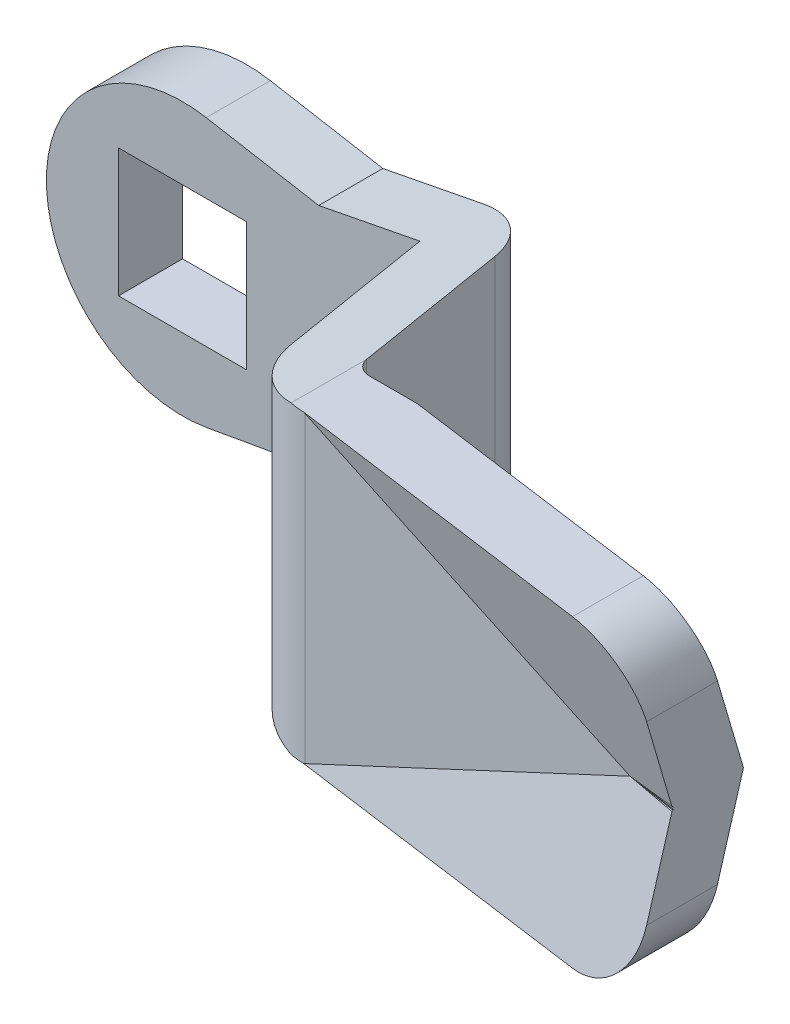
ISO-10303-21;
HEADER;
FILE_DESCRIPTION(('STEP AP214'),'2;1');
FILE_NAME('part.step','',(''),(''),'','','');
FILE_SCHEMA(('AUTOMOTIVE_DESIGN { 1 0 10303 214 1 1 1 1 }'));
ENDSEC;
DATA;
#1=APPLICATION_CONTEXT('core data for automotive mechanical design processes');
#2=APPLICATION_PROTOCOL_DEFINITION('international standard','automotive_design',2000,#1);
#3=PRODUCT_CONTEXT('',#1,'mechanical');
#4=PRODUCT('Part','Part','',(#3));
#5=PRODUCT_RELATED_PRODUCT_CATEGORY('part','',(#4));
#6=PRODUCT_DEFINITION_FORMATION('','',#4);
#7=PRODUCT_DEFINITION_CONTEXT('part definition',#1,'design');
#8=PRODUCT_DEFINITION('design','',#6,#7);
#9=PRODUCT_DEFINITION_SHAPE('','',#8);
#10=(LENGTH_UNIT() NAMED_UNIT(*) SI_UNIT(.MILLI.,.METRE.));
#11=(NAMED_UNIT(*) PLANE_ANGLE_UNIT() SI_UNIT($,.RADIAN.));
#12=(NAMED_UNIT(*) SI_UNIT($,.STERADIAN.) SOLID_ANGLE_UNIT());
#13=UNCERTAINTY_MEASURE_WITH_UNIT(LENGTH_MEASURE(1.E-05),#10,'distance_accuracy_value','');
#14=(GEOMETRIC_REPRESENTATION_CONTEXT(3) GLOBAL_UNCERTAINTY_ASSIGNED_CONTEXT((#13)) GLOBAL_UNIT_ASSIGNED_CONTEXT((#10,
#11,#12)) REPRESENTATION_CONTEXT('',''));
#15=CARTESIAN_POINT('',(0.,0.,0.));
#16=DIRECTION('',(0.,0.,1.));
#17=DIRECTION('',(1.,0.,0.));
#18=AXIS2_PLACEMENT_3D('',#15,#16,#17);
#19=CARTESIAN_POINT('',(49.9633750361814,-17.238998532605,24.1803398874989));
#20=DIRECTION('',(0.130596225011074,-0.280064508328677,-0.951056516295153));
#21=DIRECTION('',(0.,-0.959272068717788,0.282483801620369));
#22=AXIS2_PLACEMENT_3D('',#19,#20,#21);
#23=PLANE('',#22);
#24=DIRECTION('',(-0.990703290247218,0.,-0.13604040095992));
#25=VECTOR('',#24,1.);
#26=CARTESIAN_POINT('',(50.2705232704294,-9.5,21.9435575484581));
#27=LINE('',#26,#25);
#28=CARTESIAN_POINT('',(41.,-9.5,20.6705571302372));
#29=VERTEX_POINT('',#28);
#30=CARTESIAN_POINT('',(21.6766143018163,-9.5,18.0171278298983));
#31=VERTEX_POINT('',#30);
#32=EDGE_CURVE('E392',#29,#31,#27,.T.);
#33=ORIENTED_EDGE('',*,*,#32,.F.);
#34=CARTESIAN_POINT('',(41.,-5.5,19.4926481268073));
#35=DIRECTION('',(0.130596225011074,-0.280064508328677,-0.951056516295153));
#36=DIRECTION('',(0.401933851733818,-0.861949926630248,0.309016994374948));
#37=AXIS2_PLACEMENT_3D('',#34,#35,#36);
#38=ELLIPSE('',#37,4.20584889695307,4.);
#39=CARTESIAN_POINT('',(45.,-5.5,20.0419161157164));
#40=VERTEX_POINT('',#39);
#41=EDGE_CURVE('E9',#29,#40,#38,.F.);
#42=ORIENTED_EDGE('',*,*,#41,.T.);
#43=DIRECTION('',(0.,0.959272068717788,-0.28248380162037));
#44=VECTOR('',#43,1.);
#45=CARTESIAN_POINT('',(45.,-17.4236857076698,23.5531703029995));
#46=LINE('',#45,#44);
#47=CARTESIAN_POINT('',(45.,-0.136162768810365,18.4623880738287));
#48=VERTEX_POINT('',#47);
#49=EDGE_CURVE('E378',#40,#48,#46,.T.);
#50=ORIENTED_EDGE('',*,*,#49,.T.);
#51=DIRECTION('',(0.987938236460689,-0.0437421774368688,0.148541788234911));
#52=VECTOR('',#51,1.);
#53=CARTESIAN_POINT('',(51.4225647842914,-0.420529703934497,19.4280549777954));
#54=LINE('',#53,#52);
#55=CARTESIAN_POINT('',(41.9246980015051,0.,18.));
#56=VERTEX_POINT('',#55);
#57=EDGE_CURVE('E224',#56,#48,#54,.T.);
#58=ORIENTED_EDGE('',*,*,#57,.F.);
#59=DIRECTION('',(0.906307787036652,0.422618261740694,0.));
#60=VECTOR('',#59,1.);
#61=CARTESIAN_POINT('',(40.8120209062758,-0.518849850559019,18.));
#62=LINE('',#61,#60);
#63=CARTESIAN_POINT('',(21.6543363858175,-9.45222485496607,18.));
#64=VERTEX_POINT('',#63);
#65=EDGE_CURVE('E451',#56,#64,#62,.F.);
#66=ORIENTED_EDGE('',*,*,#65,.T.);
#67=DIRECTION('',(-0.401933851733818,0.861949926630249,-0.309016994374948));
#68=VECTOR('',#67,1.);
#69=CARTESIAN_POINT('',(29.6930134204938,-26.6912233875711,24.1803398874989));
#70=LINE('',#69,#68);
#71=EDGE_CURVE('E432',#31,#64,#70,.T.);
#72=ORIENTED_EDGE('',*,*,#71,.F.);
#73=EDGE_LOOP('',(#33,#42,#50,#58,#66,#72));
#74=FACE_BOUND('',#73,.T.);
#75=ADVANCED_FACE('F14',(#74),#23,.F.);
#76=CARTESIAN_POINT('',(45.,-40.,40.));
#77=DIRECTION('',(-1.,0.,0.));
#78=DIRECTION('',(0.,1.,0.));
#79=AXIS2_PLACEMENT_3D('',#76,#77,#78);
#80=PLANE('',#79);
#81=DIRECTION('',(0.,-0.959272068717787,-0.28248380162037));
#82=VECTOR('',#81,1.);
#83=CARTESIAN_POINT('',(45.,11.3997764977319,17.3569748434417));
#84=LINE('',#83,#82);
#85=CARTESIAN_POINT('',(45.,5.5,15.6196248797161));
#86=VERTEX_POINT('',#85);
#87=CARTESIAN_POINT('',(45.,0.,14.));
#88=VERTEX_POINT('',#87);
#89=EDGE_CURVE('E380',#86,#88,#84,.T.);
#90=ORIENTED_EDGE('',*,*,#89,.F.);
#91=DIRECTION('',(0.,0.,-1.));
#92=VECTOR('',#91,1.);
#93=CARTESIAN_POINT('',(45.,5.5,40.));
#94=LINE('',#93,#92);
#95=CARTESIAN_POINT('',(45.,5.5,20.0419161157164));
#96=VERTEX_POINT('',#95);
#97=EDGE_CURVE('E547',#86,#96,#94,.F.);
#98=ORIENTED_EDGE('',*,*,#97,.T.);
#99=DIRECTION('',(0.,0.959272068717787,0.28248380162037));
#100=VECTOR('',#99,1.);
#101=CARTESIAN_POINT('',(45.,19.9833092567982,24.3069212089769));
#102=LINE('',#101,#100);
#103=CARTESIAN_POINT('',(45.,0.13616276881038,18.4623880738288));
#104=VERTEX_POINT('',#103);
#105=EDGE_CURVE('E375',#104,#96,#102,.T.);
#106=ORIENTED_EDGE('',*,*,#105,.F.);
#107=DIRECTION('',(0.,-0.28248380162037,-0.959272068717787));
#108=VECTOR('',#107,1.);
#109=CARTESIAN_POINT('',(45.,2.76965012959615,27.4053110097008));
#110=LINE('',#109,#108);
#111=CARTESIAN_POINT('',(45.,0.114431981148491,18.3885936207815));
#112=VERTEX_POINT('',#111);
#113=EDGE_CURVE('E533',#104,#112,#110,.T.);
#114=ORIENTED_EDGE('',*,*,#113,.T.);
#115=CARTESIAN_POINT('',(45.,0.,18.4222912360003));
#116=VERTEX_POINT('',#115);
#117=EDGE_CURVE('E240',#116,#112,#46,.T.);
#118=ORIENTED_EDGE('',*,*,#117,.F.);
#119=DIRECTION('',(0.,-0.959272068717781,-0.282483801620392));
#120=VECTOR('',#119,1.);
#121=CARTESIAN_POINT('',(45.,-30.9610139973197,9.30497695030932));
#122=LINE('',#121,#120);
#123=CARTESIAN_POINT('',(45.,-0.114431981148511,18.3885936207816));
#124=VERTEX_POINT('',#123);
#125=EDGE_CURVE('E232',#116,#124,#122,.T.);
#126=ORIENTED_EDGE('',*,*,#125,.T.);
#127=DIRECTION('',(0.,0.28248380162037,-0.959272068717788));
#128=VECTOR('',#127,1.);
#129=CARTESIAN_POINT('',(45.,-9.15341798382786,49.0836166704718));
#130=LINE('',#129,#128);
#131=EDGE_CURVE('E218',#48,#124,#130,.T.);
#132=ORIENTED_EDGE('',*,*,#131,.F.);
#133=ORIENTED_EDGE('',*,*,#49,.F.);
#134=DIRECTION('',(0.,0.,-1.));
#135=VECTOR('',#134,1.);
#136=CARTESIAN_POINT('',(45.,-5.5,40.));
#137=LINE('',#136,#135);
#138=CARTESIAN_POINT('',(45.,-5.5,15.6196248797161));
#139=VERTEX_POINT('',#138);
#140=EDGE_CURVE('E544',#40,#139,#137,.T.);
#141=ORIENTED_EDGE('',*,*,#140,.T.);
#142=DIRECTION('',(0.,-0.959272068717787,0.28248380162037));
#143=VECTOR('',#142,1.);
#144=CARTESIAN_POINT('',(45.,-26.2800452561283,21.7388754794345));
#145=LINE('',#144,#143);
#146=EDGE_CURVE('E382',#88,#139,#145,.T.);
#147=ORIENTED_EDGE('',*,*,#146,.F.);
#148=EDGE_LOOP('',(#90,#98,#106,#114,#118,#126,#132,#133,#141,#147));
#149=FACE_BOUND('',#148,.T.);
#150=ADVANCED_FACE('F238',(#149),#80,.F.);
#151=CARTESIAN_POINT('',(10.5,-2.8,-2.4));
#152=DIRECTION('',(1.,0.,0.));
#153=DIRECTION('',(0.,0.,1.));
#154=AXIS2_PLACEMENT_3D('',#151,#152,#153);
#155=PLANE('',#154);
#156=DIRECTION('',(0.,0.,1.));
#157=VECTOR('',#156,1.);
#158=CARTESIAN_POINT('',(10.5,-2.8,-2.4));
#159=LINE('',#158,#157);
#160=CARTESIAN_POINT('',(10.5,-2.8,-0.400000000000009));
#161=VERTEX_POINT('',#160);
#162=CARTESIAN_POINT('',(10.5,-2.8,0.));
#163=VERTEX_POINT('',#162);
#164=EDGE_CURVE('E285',#161,#163,#159,.T.);
#165=ORIENTED_EDGE('',*,*,#164,.F.);
#166=DIRECTION('',(0.,-1.,0.));
#167=VECTOR('',#166,1.);
#168=CARTESIAN_POINT('',(10.5,9.5,-0.400000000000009));
#169=LINE('',#168,#167);
#170=CARTESIAN_POINT('',(10.5,2.8,-0.400000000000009));
#171=VERTEX_POINT('',#170);
#172=EDGE_CURVE('E251',#171,#161,#169,.T.);
#173=ORIENTED_EDGE('',*,*,#172,.F.);
#174=DIRECTION('',(0.,0.,1.));
#175=VECTOR('',#174,1.);
#176=CARTESIAN_POINT('',(10.5,2.8,-2.4));
#177=LINE('',#176,#175);
#178=CARTESIAN_POINT('',(10.5,2.8,0.));
#179=VERTEX_POINT('',#178);
#180=EDGE_CURVE('E277',#171,#179,#177,.T.);
#181=ORIENTED_EDGE('',*,*,#180,.T.);
#182=DIRECTION('',(0.,1.,0.));
#183=VECTOR('',#182,1.);
#184=CARTESIAN_POINT('',(10.5,-2.8,0.));
#185=LINE('',#184,#183);
#186=EDGE_CURVE('E258',#163,#179,#185,.T.);
#187=ORIENTED_EDGE('',*,*,#186,.F.);
#188=EDGE_LOOP('',(#165,#173,#181,#187));
#189=FACE_BOUND('',#188,.T.);
#190=ADVANCED_FACE('F584',(#189),#155,.T.);
#191=CARTESIAN_POINT('',(10.5,-2.8,-2.4));
#192=DIRECTION('',(0.,1.,0.));
#193=DIRECTION('',(1.,0.,0.));
#194=AXIS2_PLACEMENT_3D('',#191,#192,#193);
#195=PLANE('',#194);
#196=DIRECTION('',(0.707106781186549,0.,0.707106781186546));
#197=VECTOR('',#196,1.);
#198=CARTESIAN_POINT('',(8.5,-2.8,-2.4));
#199=LINE('',#198,#197);
#200=CARTESIAN_POINT('',(8.5,-2.8,-2.4));
#201=VERTEX_POINT('',#200);
#202=EDGE_CURVE('E248',#201,#161,#199,.T.);
#203=ORIENTED_EDGE('',*,*,#202,.T.);
#204=ORIENTED_EDGE('',*,*,#164,.T.);
#205=DIRECTION('',(-1.,0.,0.));
#206=VECTOR('',#205,1.);
#207=CARTESIAN_POINT('',(10.5,-2.8,0.));
#208=LINE('',#207,#206);
#209=CARTESIAN_POINT('',(6.5,-2.8,0.));
#210=VERTEX_POINT('',#209);
#211=EDGE_CURVE('E266',#163,#210,#208,.T.);
#212=ORIENTED_EDGE('',*,*,#211,.T.);
#213=DIRECTION('',(0.,0.,1.));
#214=VECTOR('',#213,1.);
#215=CARTESIAN_POINT('',(6.5,-2.8,-2.4));
#216=LINE('',#215,#214);
#217=CARTESIAN_POINT('',(6.5,-2.8,-2.4));
#218=VERTEX_POINT('',#217);
#219=EDGE_CURVE('E282',#218,#210,#216,.T.);
#220=ORIENTED_EDGE('',*,*,#219,.F.);
#221=DIRECTION('',(-1.,0.,0.));
#222=VECTOR('',#221,1.);
#223=CARTESIAN_POINT('',(10.5,-2.8,-2.4));
#224=LINE('',#223,#222);
#225=EDGE_CURVE('E275',#201,#218,#224,.T.);
#226=ORIENTED_EDGE('',*,*,#225,.F.);
#227=EDGE_LOOP('',(#203,#204,#212,#220,#226));
#228=FACE_BOUND('',#227,.T.);
#229=ADVANCED_FACE('F818',(#228),#195,.F.);
#230=CARTESIAN_POINT('',(6.5,2.8,-2.4));
#231=DIRECTION('',(0.,-1.,0.));
#232=DIRECTION('',(-1.,0.,0.));
#233=AXIS2_PLACEMENT_3D('',#230,#231,#232);
#234=PLANE('',#233);
#235=DIRECTION('',(0.707106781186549,0.,0.707106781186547));
#236=VECTOR('',#235,1.);
#237=CARTESIAN_POINT('',(7.5,2.8,-3.4));
#238=LINE('',#237,#236);
#239=CARTESIAN_POINT('',(8.5,2.8,-2.4));
#240=VERTEX_POINT('',#239);
#241=EDGE_CURVE('E256',#240,#171,#238,.T.);
#242=ORIENTED_EDGE('',*,*,#241,.F.);
#243=DIRECTION('',(1.,0.,0.));
#244=VECTOR('',#243,1.);
#245=CARTESIAN_POINT('',(6.5,2.8,-2.4));
#246=LINE('',#245,#244);
#247=CARTESIAN_POINT('',(6.5,2.8,-2.4));
#248=VERTEX_POINT('',#247);
#249=EDGE_CURVE('E269',#248,#240,#246,.T.);
#250=ORIENTED_EDGE('',*,*,#249,.F.);
#251=DIRECTION('',(0.,0.,1.));
#252=VECTOR('',#251,1.);
#253=CARTESIAN_POINT('',(6.5,2.8,-2.4));
#254=LINE('',#253,#252);
#255=CARTESIAN_POINT('',(6.5,2.8,0.));
#256=VERTEX_POINT('',#255);
#257=EDGE_CURVE('E279',#248,#256,#254,.T.);
#258=ORIENTED_EDGE('',*,*,#257,.T.);
#259=DIRECTION('',(1.,0.,0.));
#260=VECTOR('',#259,1.);
#261=CARTESIAN_POINT('',(6.5,2.8,0.));
#262=LINE('',#261,#260);
#263=EDGE_CURVE('E261',#256,#179,#262,.T.);
#264=ORIENTED_EDGE('',*,*,#263,.T.);
#265=ORIENTED_EDGE('',*,*,#180,.F.);
#266=EDGE_LOOP('',(#242,#250,#258,#264,#265));
#267=FACE_BOUND('',#266,.T.);
#268=ADVANCED_FACE('F810',(#267),#234,.F.);
#269=CARTESIAN_POINT('',(10.5,2.8,-2.4));
#270=DIRECTION('',(0.,0.,-1.));
#271=DIRECTION('',(1.,0.,0.));
#272=AXIS2_PLACEMENT_3D('',#269,#270,#271);
#273=PLANE('',#272);
#274=ORIENTED_EDGE('',*,*,#249,.T.);
#275=DIRECTION('',(0.,-1.,0.));
#276=VECTOR('',#275,1.);
#277=CARTESIAN_POINT('',(8.5,9.5,-2.4));
#278=LINE('',#277,#276);
#279=EDGE_CURVE('E253',#240,#201,#278,.T.);
#280=ORIENTED_EDGE('',*,*,#279,.T.);
#281=ORIENTED_EDGE('',*,*,#225,.T.);
#282=DIRECTION('',(0.,-1.,0.));
#283=VECTOR('',#282,1.);
#284=CARTESIAN_POINT('',(6.5,2.8,-2.4));
#285=LINE('',#284,#283);
#286=EDGE_CURVE('E272',#248,#218,#285,.T.);
#287=ORIENTED_EDGE('',*,*,#286,.F.);
#288=EDGE_LOOP('',(#274,#280,#281,#287));
#289=FACE_BOUND('',#288,.T.);
#290=ADVANCED_FACE('F670',(#289),#273,.T.);
#291=CARTESIAN_POINT('',(14.811330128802,-9.5,0.));
#292=DIRECTION('',(0.,0.,-1.));
#293=DIRECTION('',(1.,0.,0.));
#294=AXIS2_PLACEMENT_3D('',#291,#292,#293);
#295=PLANE('',#294);
#296=DIRECTION('',(0.,1.,0.));
#297=VECTOR('',#296,1.);
#298=CARTESIAN_POINT('',(14.811330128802,-9.5,0.));
#299=LINE('',#298,#297);
#300=CARTESIAN_POINT('',(14.811330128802,-8.36066332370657,0.));
#301=VERTEX_POINT('',#300);
#302=CARTESIAN_POINT('',(14.811330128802,8.36066332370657,0.));
#303=VERTEX_POINT('',#302);
#304=EDGE_CURVE('E479',#301,#303,#299,.T.);
#305=ORIENTED_EDGE('',*,*,#304,.F.);
#306=DIRECTION('',(-0.981627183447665,0.190808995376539,0.));
#307=VECTOR('',#306,1.);
#308=CARTESIAN_POINT('',(15.024731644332,-8.40214437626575,0.));
#309=LINE('',#308,#307);
#310=CARTESIAN_POINT('',(8.49590470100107,-7.13306897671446,0.));
#311=VERTEX_POINT('',#310);
#312=EDGE_CURVE('E325',#301,#311,#309,.T.);
#313=ORIENTED_EDGE('',*,*,#312,.T.);
#314=DIRECTION('',(0.984807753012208,0.17364817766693,0.));
#315=VECTOR('',#314,1.);
#316=CARTESIAN_POINT('',(14.2161277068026,-6.12443932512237,0.));
#317=LINE('',#316,#315);
#318=CARTESIAN_POINT('',(1.47600951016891,-8.37086590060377,0.));
#319=VERTEX_POINT('',#318);
#320=EDGE_CURVE('E531',#319,#311,#317,.T.);
#321=ORIENTED_EDGE('',*,*,#320,.F.);
#322=CARTESIAN_POINT('',(0.,0.,0.));
#323=DIRECTION('',(0.,0.,-1.));
#324=DIRECTION('',(1.,0.,0.));
#325=AXIS2_PLACEMENT_3D('',#322,#323,#324);
#326=CIRCLE('',#325,8.5);
#327=CARTESIAN_POINT('',(1.47600951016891,8.37086590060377,0.));
#328=VERTEX_POINT('',#327);
#329=EDGE_CURVE('E334',#319,#328,#326,.T.);
#330=ORIENTED_EDGE('',*,*,#329,.T.);
#331=DIRECTION('',(0.984807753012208,-0.17364817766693,0.));
#332=VECTOR('',#331,1.);
#333=CARTESIAN_POINT('',(17.4653190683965,5.5515192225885,0.));
#334=LINE('',#333,#332);
#335=CARTESIAN_POINT('',(8.49590470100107,7.13306897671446,0.));
#336=VERTEX_POINT('',#335);
#337=EDGE_CURVE('E534',#328,#336,#334,.T.);
#338=ORIENTED_EDGE('',*,*,#337,.T.);
#339=DIRECTION('',(-0.981627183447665,-0.190808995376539,0.));
#340=VECTOR('',#339,1.);
#341=CARTESIAN_POINT('',(11.465969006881,7.71039099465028,0.));
#342=LINE('',#341,#340);
#343=EDGE_CURVE('E308',#303,#336,#342,.T.);
#344=ORIENTED_EDGE('',*,*,#343,.F.);
#345=EDGE_LOOP('',(#305,#313,#321,#330,#338,#344));
#346=FACE_BOUND('',#345,.T.);
#347=DIRECTION('',(1.,0.,0.));
#348=VECTOR('',#347,1.);
#349=CARTESIAN_POINT('',(-4.,4.,0.));
#350=LINE('',#349,#348);
#351=CARTESIAN_POINT('',(-4.,4.,0.));
#352=VERTEX_POINT('',#351);
#353=CARTESIAN_POINT('',(4.,4.,0.));
#354=VERTEX_POINT('',#353);
#355=EDGE_CURVE('E352',#352,#354,#350,.T.);
#356=ORIENTED_EDGE('',*,*,#355,.F.);
#357=DIRECTION('',(0.,-1.,0.));
#358=VECTOR('',#357,1.);
#359=CARTESIAN_POINT('',(-4.,4.,0.));
#360=LINE('',#359,#358);
#361=CARTESIAN_POINT('',(-4.,-4.,0.));
#362=VERTEX_POINT('',#361);
#363=EDGE_CURVE('E343',#352,#362,#360,.T.);
#364=ORIENTED_EDGE('',*,*,#363,.T.);
#365=DIRECTION('',(-1.,0.,0.));
#366=VECTOR('',#365,1.);
#367=CARTESIAN_POINT('',(4.,-4.,0.));
#368=LINE('',#367,#366);
#369=CARTESIAN_POINT('',(4.,-4.,0.));
#370=VERTEX_POINT('',#369);
#371=EDGE_CURVE('E346',#370,#362,#368,.T.);
#372=ORIENTED_EDGE('',*,*,#371,.F.);
#373=DIRECTION('',(0.,1.,0.));
#374=VECTOR('',#373,1.);
#375=CARTESIAN_POINT('',(4.,-4.,0.));
#376=LINE('',#375,#374);
#377=EDGE_CURVE('E349',#370,#354,#376,.T.);
#378=ORIENTED_EDGE('',*,*,#377,.T.);
#379=EDGE_LOOP('',(#356,#364,#372,#378));
#380=FACE_BOUND('',#379,.T.);
#381=ORIENTED_EDGE('',*,*,#211,.F.);
#382=ORIENTED_EDGE('',*,*,#186,.T.);
#383=ORIENTED_EDGE('',*,*,#263,.F.);
#384=DIRECTION('',(0.,-1.,0.));
#385=VECTOR('',#384,1.);
#386=CARTESIAN_POINT('',(6.5,2.8,0.));
#387=LINE('',#386,#385);
#388=EDGE_CURVE('E264',#256,#210,#387,.T.);
#389=ORIENTED_EDGE('',*,*,#388,.T.);
#390=EDGE_LOOP('',(#381,#382,#383,#389));
#391=FACE_BOUND('',#390,.T.);
#392=ADVANCED_FACE('F616',(#346,#380,#391),#295,.T.);
#393=CARTESIAN_POINT('',(14.811330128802,-9.5,4.));
#394=DIRECTION('',(0.,0.,-1.));
#395=DIRECTION('',(1.,0.,0.));
#396=AXIS2_PLACEMENT_3D('',#393,#394,#395);
#397=PLANE('',#396);
#398=DIRECTION('',(0.,-1.,0.));
#399=VECTOR('',#398,1.);
#400=CARTESIAN_POINT('',(-4.,-9.5,4.));
#401=LINE('',#400,#399);
#402=CARTESIAN_POINT('',(-4.,4.,4.));
#403=VERTEX_POINT('',#402);
#404=CARTESIAN_POINT('',(-4.,-4.,4.));
#405=VERTEX_POINT('',#404);
#406=EDGE_CURVE('E373',#403,#405,#401,.T.);
#407=ORIENTED_EDGE('',*,*,#406,.F.);
#408=DIRECTION('',(1.,0.,0.));
#409=VECTOR('',#408,1.);
#410=CARTESIAN_POINT('',(14.811330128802,4.,4.));
#411=LINE('',#410,#409);
#412=CARTESIAN_POINT('',(4.,4.,4.));
#413=VERTEX_POINT('',#412);
#414=EDGE_CURVE('E364',#403,#413,#411,.T.);
#415=ORIENTED_EDGE('',*,*,#414,.T.);
#416=DIRECTION('',(0.,1.,0.));
#417=VECTOR('',#416,1.);
#418=CARTESIAN_POINT('',(4.,-9.5,4.));
#419=LINE('',#418,#417);
#420=CARTESIAN_POINT('',(4.,-4.,4.));
#421=VERTEX_POINT('',#420);
#422=EDGE_CURVE('E367',#421,#413,#419,.T.);
#423=ORIENTED_EDGE('',*,*,#422,.F.);
#424=DIRECTION('',(-1.,0.,0.));
#425=VECTOR('',#424,1.);
#426=CARTESIAN_POINT('',(14.811330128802,-4.,4.));
#427=LINE('',#426,#425);
#428=EDGE_CURVE('E370',#421,#405,#427,.T.);
#429=ORIENTED_EDGE('',*,*,#428,.T.);
#430=EDGE_LOOP('',(#407,#415,#423,#429));
#431=FACE_BOUND('',#430,.T.);
#432=DIRECTION('',(-0.981627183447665,0.190808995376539,0.));
#433=VECTOR('',#432,1.);
#434=CARTESIAN_POINT('',(15.024731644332,-8.40214437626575,4.));
#435=LINE('',#434,#433);
#436=CARTESIAN_POINT('',(14.811330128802,-8.36066332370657,4.));
#437=VERTEX_POINT('',#436);
#438=CARTESIAN_POINT('',(8.49590470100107,-7.13306897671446,4.));
#439=VERTEX_POINT('',#438);
#440=EDGE_CURVE('E332',#437,#439,#435,.T.);
#441=ORIENTED_EDGE('',*,*,#440,.F.);
#442=DIRECTION('',(0.,1.,0.));
#443=VECTOR('',#442,1.);
#444=CARTESIAN_POINT('',(14.811330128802,-9.5,4.));
#445=LINE('',#444,#443);
#446=CARTESIAN_POINT('',(14.811330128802,8.36066332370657,4.));
#447=VERTEX_POINT('',#446);
#448=EDGE_CURVE('E482',#437,#447,#445,.T.);
#449=ORIENTED_EDGE('',*,*,#448,.T.);
#450=DIRECTION('',(-0.981627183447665,-0.190808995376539,0.));
#451=VECTOR('',#450,1.);
#452=CARTESIAN_POINT('',(11.465969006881,7.71039099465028,4.));
#453=LINE('',#452,#451);
#454=CARTESIAN_POINT('',(8.49590470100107,7.13306897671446,4.));
#455=VERTEX_POINT('',#454);
#456=EDGE_CURVE('E316',#447,#455,#453,.T.);
#457=ORIENTED_EDGE('',*,*,#456,.T.);
#458=DIRECTION('',(0.984807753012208,-0.17364817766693,0.));
#459=VECTOR('',#458,1.);
#460=CARTESIAN_POINT('',(17.4653190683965,5.5515192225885,4.));
#461=LINE('',#460,#459);
#462=CARTESIAN_POINT('',(1.47600951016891,8.37086590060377,4.));
#463=VERTEX_POINT('',#462);
#464=EDGE_CURVE('E338',#463,#455,#461,.T.);
#465=ORIENTED_EDGE('',*,*,#464,.F.);
#466=CARTESIAN_POINT('',(0.,0.,4.));
#467=DIRECTION('',(0.,0.,-1.));
#468=DIRECTION('',(1.,0.,0.));
#469=AXIS2_PLACEMENT_3D('',#466,#467,#468);
#470=CIRCLE('',#469,8.5);
#471=CARTESIAN_POINT('',(1.47600951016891,-8.37086590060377,4.));
#472=VERTEX_POINT('',#471);
#473=EDGE_CURVE('E336',#472,#463,#470,.T.);
#474=ORIENTED_EDGE('',*,*,#473,.F.);
#475=DIRECTION('',(0.984807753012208,0.17364817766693,0.));
#476=VECTOR('',#475,1.);
#477=CARTESIAN_POINT('',(14.2161277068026,-6.12443932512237,4.));
#478=LINE('',#477,#476);
#479=EDGE_CURVE('E340',#472,#439,#478,.T.);
#480=ORIENTED_EDGE('',*,*,#479,.T.);
#481=EDGE_LOOP('',(#441,#449,#457,#465,#474,#480));
#482=FACE_BOUND('',#481,.T.);
#483=ADVANCED_FACE('F521',(#431,#482),#397,.F.);
#484=CARTESIAN_POINT('',(21.6543363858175,-9.5,13.));
#485=DIRECTION('',(0.,1.,0.));
#486=DIRECTION('',(1.,0.,0.));
#487=AXIS2_PLACEMENT_3D('',#484,#485,#486);
#488=CYLINDRICAL_SURFACE('',#487,5.);
#489=CARTESIAN_POINT('',(21.6543363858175,-9.69080899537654,13.));
#490=DIRECTION('',(-0.190808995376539,-0.981627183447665,0.));
#491=DIRECTION('',(-0.981627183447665,0.190808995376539,0.));
#492=AXIS2_PLACEMENT_3D('',#489,#490,#491);
#493=ELLIPSE('',#492,5.09358347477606,5.);
#494=CARTESIAN_POINT('',(20.6727092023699,-9.5,17.9026939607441));
#495=VERTEX_POINT('',#494);
#496=CARTESIAN_POINT('',(16.7462004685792,-8.73676401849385,13.9540449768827));
#497=VERTEX_POINT('',#496);
#498=EDGE_CURVE('E330',#495,#497,#493,.T.);
#499=ORIENTED_EDGE('',*,*,#498,.F.);
#500=CARTESIAN_POINT('',(21.6543363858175,-9.5,13.));
#501=DIRECTION('',(0.,-1.,0.));
#502=DIRECTION('',(-1.,0.,0.));
#503=AXIS2_PLACEMENT_3D('',#500,#501,#502);
#504=CIRCLE('',#503,5.);
#505=CARTESIAN_POINT('',(21.5526768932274,-9.5,17.9989664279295));
#506=VERTEX_POINT('',#505);
#507=EDGE_CURVE('E467',#506,#495,#504,.T.);
#508=ORIENTED_EDGE('',*,*,#507,.F.);
#509=CARTESIAN_POINT('',(21.6543363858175,-11.244770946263,13.));
#510=DIRECTION('',(-0.401933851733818,0.861949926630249,-0.309016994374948));
#511=DIRECTION('',(0.683336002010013,0.506993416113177,0.52536614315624));
#512=AXIS2_PLACEMENT_3D('',#509,#510,#511);
#513=ELLIPSE('',#512,5.80080100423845,5.);
#514=EDGE_CURVE('E448',#64,#506,#513,.F.);
#515=ORIENTED_EDGE('',*,*,#514,.F.);
#516=DIRECTION('',(0.,1.,0.));
#517=VECTOR('',#516,1.);
#518=CARTESIAN_POINT('',(21.6543363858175,-9.5,18.));
#519=LINE('',#518,#517);
#520=CARTESIAN_POINT('',(21.6543363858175,9.45222485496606,18.));
#521=VERTEX_POINT('',#520);
#522=EDGE_CURVE('E416',#64,#521,#519,.T.);
#523=ORIENTED_EDGE('',*,*,#522,.T.);
#524=CARTESIAN_POINT('',(21.6543363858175,11.244770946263,13.));
#525=DIRECTION('',(-0.401933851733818,-0.861949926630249,-0.309016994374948));
#526=DIRECTION('',(-0.683336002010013,0.506993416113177,-0.52536614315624));
#527=AXIS2_PLACEMENT_3D('',#524,#525,#526);
#528=ELLIPSE('',#527,5.80080100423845,5.);
#529=CARTESIAN_POINT('',(21.5526768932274,9.5,17.9989664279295));
#530=VERTEX_POINT('',#529);
#531=EDGE_CURVE('E442',#521,#530,#528,.T.);
#532=ORIENTED_EDGE('',*,*,#531,.T.);
#533=CARTESIAN_POINT('',(21.6543363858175,9.5,13.));
#534=DIRECTION('',(0.,-1.,0.));
#535=DIRECTION('',(-1.,0.,0.));
#536=AXIS2_PLACEMENT_3D('',#533,#534,#535);
#537=CIRCLE('',#536,5.);
#538=CARTESIAN_POINT('',(20.6727092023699,9.5,17.9026939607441));
#539=VERTEX_POINT('',#538);
#540=EDGE_CURVE('E459',#530,#539,#537,.T.);
#541=ORIENTED_EDGE('',*,*,#540,.T.);
#542=CARTESIAN_POINT('',(21.6543363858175,9.69080899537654,13.));
#543=DIRECTION('',(0.190808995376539,-0.981627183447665,0.));
#544=DIRECTION('',(0.981627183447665,0.190808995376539,0.));
#545=AXIS2_PLACEMENT_3D('',#542,#543,#544);
#546=ELLIPSE('',#545,5.09358347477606,5.);
#547=CARTESIAN_POINT('',(16.7462004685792,8.73676401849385,13.9540449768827));
#548=VERTEX_POINT('',#547);
#549=EDGE_CURVE('E313',#539,#548,#546,.T.);
#550=ORIENTED_EDGE('',*,*,#549,.T.);
#551=DIRECTION('',(0.,1.,0.));
#552=VECTOR('',#551,1.);
#553=CARTESIAN_POINT('',(16.7462004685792,-9.5,13.9540449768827));
#554=LINE('',#553,#552);
#555=EDGE_CURVE('E484',#497,#548,#554,.T.);
#556=ORIENTED_EDGE('',*,*,#555,.F.);
#557=EDGE_LOOP('',(#499,#508,#515,#523,#532,#541,#550,#556));
#558=FACE_BOUND('',#557,.T.);
#559=ADVANCED_FACE('F494',(#558),#488,.T.);
#560=CARTESIAN_POINT('',(21.6543363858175,-9.5,13.));
#561=DIRECTION('',(0.,-1.,0.));
#562=DIRECTION('',(-1.,0.,0.));
#563=AXIS2_PLACEMENT_3D('',#560,#561,#562);
#564=PLANE('',#563);
#565=DIRECTION('',(0.990703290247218,0.,0.13604040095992));
#566=VECTOR('',#565,1.);
#567=CARTESIAN_POINT('',(33.3500490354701,-9.5,15.1977975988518));
#568=LINE('',#567,#566);
#569=CARTESIAN_POINT('',(24.6271842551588,-9.5,14.));
#570=VERTEX_POINT('',#569);
#571=CARTESIAN_POINT('',(41.,-9.5,16.2482658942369));
#572=VERTEX_POINT('',#571);
#573=EDGE_CURVE('E415',#570,#572,#568,.T.);
#574=ORIENTED_EDGE('',*,*,#573,.T.);
#575=DIRECTION('',(0.,0.,-1.));
#576=VECTOR('',#575,1.);
#577=CARTESIAN_POINT('',(41.,-9.5,40.));
#578=LINE('',#577,#576);
#579=EDGE_CURVE('E22',#572,#29,#578,.F.);
#580=ORIENTED_EDGE('',*,*,#579,.T.);
#581=ORIENTED_EDGE('',*,*,#32,.T.);
#582=CARTESIAN_POINT('',(21.6766143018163,-9.5,18.0171278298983));
#583=CARTESIAN_POINT('',(21.6559307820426,-9.50000000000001,18.0142871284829));
#584=CARTESIAN_POINT('',(21.6352609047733,-9.50000000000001,18.011353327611));
#585=CARTESIAN_POINT('',(21.5939484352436,-9.50000000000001,18.0052995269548));
#586=CARTESIAN_POINT('',(21.5733058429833,-9.50000000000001,18.0021795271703));
#587=CARTESIAN_POINT('',(21.5526768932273,-9.5,17.9989664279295));
#588=B_SPLINE_CURVE_WITH_KNOTS('',3,(#582,#583,#584,#585,#586,#587),.UNSPECIFIED.,.F.,.F.,(4,2,
4),(0.,0.0626311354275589,0.125262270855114),.UNSPECIFIED.);
#589=EDGE_CURVE('E384',#31,#506,#588,.T.);
#590=ORIENTED_EDGE('',*,*,#589,.T.);
#591=ORIENTED_EDGE('',*,*,#507,.T.);
#592=DIRECTION('',(0.,0.,-1.));
#593=VECTOR('',#592,1.);
#594=CARTESIAN_POINT('',(20.6727092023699,-9.5,25.));
#595=LINE('',#594,#593);
#596=CARTESIAN_POINT('',(20.6727092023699,-9.5,13.1908089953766));
#597=VERTEX_POINT('',#596);
#598=EDGE_CURVE('E301',#495,#597,#595,.T.);
#599=ORIENTED_EDGE('',*,*,#598,.T.);
#600=CARTESIAN_POINT('',(21.6543363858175,-9.5,13.));
#601=DIRECTION('',(0.,-1.,0.));
#602=DIRECTION('',(-1.,0.,0.));
#603=AXIS2_PLACEMENT_3D('',#600,#601,#602);
#604=CIRCLE('',#603,1.);
#605=CARTESIAN_POINT('',(21.6543363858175,-9.5,14.));
#606=VERTEX_POINT('',#605);
#607=EDGE_CURVE('E464',#606,#597,#604,.T.);
#608=ORIENTED_EDGE('',*,*,#607,.F.);
#609=DIRECTION('',(-1.,0.,0.));
#610=VECTOR('',#609,1.);
#611=CARTESIAN_POINT('',(45.,-9.5,14.));
#612=LINE('',#611,#610);
#613=EDGE_CURVE('E462',#570,#606,#612,.T.);
#614=ORIENTED_EDGE('',*,*,#613,.F.);
#615=EDGE_LOOP('',(#574,#580,#581,#590,#591,#599,#608,#614));
#616=FACE_BOUND('',#615,.T.);
#617=ADVANCED_FACE('F561',(#616),#564,.T.);
#618=CARTESIAN_POINT('',(16.7462004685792,-9.5,13.9540449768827));
#619=DIRECTION('',(0.981627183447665,0.,-0.190808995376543));
#620=DIRECTION('',(0.190808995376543,0.,0.981627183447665));
#621=AXIS2_PLACEMENT_3D('',#618,#619,#620);
#622=PLANE('',#621);
#623=DIRECTION('',(-0.190677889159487,0.0370640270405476,-0.980952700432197));
#624=VECTOR('',#623,1.);
#625=CARTESIAN_POINT('',(16.7515944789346,-8.73781250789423,13.981794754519));
#626=LINE('',#625,#624);
#627=EDGE_CURVE('E328',#497,#437,#626,.T.);
#628=ORIENTED_EDGE('',*,*,#627,.F.);
#629=ORIENTED_EDGE('',*,*,#555,.T.);
#630=DIRECTION('',(-0.190677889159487,-0.0370640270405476,-0.980952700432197));
#631=VECTOR('',#630,1.);
#632=CARTESIAN_POINT('',(16.6173159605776,8.71171140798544,13.290991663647));
#633=LINE('',#632,#631);
#634=EDGE_CURVE('E310',#548,#447,#633,.T.);
#635=ORIENTED_EDGE('',*,*,#634,.T.);
#636=ORIENTED_EDGE('',*,*,#448,.F.);
#637=EDGE_LOOP('',(#628,#629,#635,#636));
#638=FACE_BOUND('',#637,.T.);
#639=ADVANCED_FACE('F518',(#638),#622,.F.);
#640=CARTESIAN_POINT('',(14.811330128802,-9.5,4.));
#641=DIRECTION('',(0.,1.,0.));
#642=DIRECTION('',(1.,0.,0.));
#643=AXIS2_PLACEMENT_3D('',#640,#641,#642);
#644=CYLINDRICAL_SURFACE('',#643,4.);
#645=DIRECTION('',(0.,1.,0.));
#646=VECTOR('',#645,1.);
#647=CARTESIAN_POINT('',(18.7378388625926,-9.5,3.23676401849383));
#648=LINE('',#647,#646);
#649=CARTESIAN_POINT('',(18.7378388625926,-9.12389930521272,3.23676401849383));
#650=VERTEX_POINT('',#649);
#651=CARTESIAN_POINT('',(18.7378388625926,9.12389930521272,3.23676401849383));
#652=VERTEX_POINT('',#651);
#653=EDGE_CURVE('E476',#650,#652,#648,.T.);
#654=ORIENTED_EDGE('',*,*,#653,.F.);
#655=CARTESIAN_POINT('',(14.811330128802,-8.36066332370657,4.));
#656=DIRECTION('',(-0.190808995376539,-0.981627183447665,0.));
#657=DIRECTION('',(-0.981627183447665,0.190808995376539,0.));
#658=AXIS2_PLACEMENT_3D('',#655,#656,#657);
#659=ELLIPSE('',#658,4.07486677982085,4.);
#660=EDGE_CURVE('E322',#650,#301,#659,.F.);
#661=ORIENTED_EDGE('',*,*,#660,.T.);
#662=ORIENTED_EDGE('',*,*,#304,.T.);
#663=CARTESIAN_POINT('',(14.811330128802,8.36066332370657,4.));
#664=DIRECTION('',(0.190808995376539,-0.981627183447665,0.));
#665=DIRECTION('',(0.981627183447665,0.190808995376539,0.));
#666=AXIS2_PLACEMENT_3D('',#663,#664,#665);
#667=ELLIPSE('',#666,4.07486677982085,4.);
#668=EDGE_CURVE('E306',#652,#303,#667,.F.);
#669=ORIENTED_EDGE('',*,*,#668,.F.);
#670=EDGE_LOOP('',(#654,#661,#662,#669));
#671=FACE_BOUND('',#670,.T.);
#672=ADVANCED_FACE('F595',(#671),#644,.T.);
#673=CARTESIAN_POINT('',(20.6727092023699,-9.5,13.1908089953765));
#674=DIRECTION('',(0.981627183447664,0.,-0.190808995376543));
#675=DIRECTION('',(0.190808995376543,0.,0.981627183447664));
#676=AXIS2_PLACEMENT_3D('',#673,#674,#675);
#677=PLANE('',#676);
#678=DIRECTION('',(0.,1.,0.));
#679=VECTOR('',#678,1.);
#680=CARTESIAN_POINT('',(20.6727092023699,-9.5,13.1908089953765));
#681=LINE('',#680,#679);
#682=CARTESIAN_POINT('',(20.6727092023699,9.5,13.1908089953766));
#683=VERTEX_POINT('',#682);
#684=EDGE_CURVE('E473',#597,#683,#681,.T.);
#685=ORIENTED_EDGE('',*,*,#684,.F.);
#686=DIRECTION('',(-0.190677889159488,0.0370640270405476,-0.980952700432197));
#687=VECTOR('',#686,1.);
#688=CARTESIAN_POINT('',(20.6727092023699,-9.5,13.1908089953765));
#689=LINE('',#688,#687);
#690=EDGE_CURVE('E319',#597,#650,#689,.T.);
#691=ORIENTED_EDGE('',*,*,#690,.T.);
#692=ORIENTED_EDGE('',*,*,#653,.T.);
#693=DIRECTION('',(-0.190677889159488,-0.0370640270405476,-0.980952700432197));
#694=VECTOR('',#693,1.);
#695=CARTESIAN_POINT('',(20.5384306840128,9.47389890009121,12.5000059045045));
#696=LINE('',#695,#694);
#697=EDGE_CURVE('E304',#683,#652,#696,.T.);
#698=ORIENTED_EDGE('',*,*,#697,.F.);
#699=EDGE_LOOP('',(#685,#691,#692,#698));
#700=FACE_BOUND('',#699,.T.);
#701=ADVANCED_FACE('F587',(#700),#677,.T.);
#702=DIRECTION('',(0.991435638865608,0.0368913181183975,0.125277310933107));
#703=VECTOR('',#702,1.);
#704=CARTESIAN_POINT('',(41.9246980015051,0.,18.));
#705=LINE('',#704,#703);
#706=EDGE_CURVE('E245',#56,#112,#705,.T.);
#707=ORIENTED_EDGE('',*,*,#706,.F.);
#708=DIRECTION('',(0.990703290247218,0.,0.136040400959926));
#709=VECTOR('',#708,1.);
#710=CARTESIAN_POINT('',(50.6475627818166,-1.94289029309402E-13,19.1977975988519));
#711=LINE('',#710,#709);
#712=EDGE_CURVE('E228',#56,#116,#711,.T.);
#713=ORIENTED_EDGE('',*,*,#712,.T.);
#714=ORIENTED_EDGE('',*,*,#117,.T.);
#715=EDGE_LOOP('',(#707,#713,#714));
#716=FACE_BOUND('',#715,.T.);
#717=ADVANCED_FACE('F579',(#716),#23,.F.);
#718=CARTESIAN_POINT('',(29.6930134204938,-28.483769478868,19.1803398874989));
#719=DIRECTION('',(0.401933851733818,-0.861949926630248,0.309016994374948));
#720=DIRECTION('',(0.683336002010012,0.506993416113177,0.52536614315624));
#721=AXIS2_PLACEMENT_3D('',#718,#719,#720);
#722=ELLIPSE('',#721,5.80080100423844,5.);
#723=DIRECTION('',(-0.401933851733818,0.861949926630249,-0.309016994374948));
#724=VECTOR('',#723,1.);
#725=SURFACE_OF_LINEAR_EXTRUSION('',#722,#724);
#726=ORIENTED_EDGE('',*,*,#589,.F.);
#727=ORIENTED_EDGE('',*,*,#71,.T.);
#728=ORIENTED_EDGE('',*,*,#514,.T.);
#729=EDGE_LOOP('',(#726,#727,#728));
#730=FACE_BOUND('',#729,.T.);
#731=ADVANCED_FACE('F394',(#730),#725,.F.);
#732=CARTESIAN_POINT('',(32.6658612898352,-26.7389985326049,20.1803398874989));
#733=DIRECTION('',(-0.130596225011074,0.280064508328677,0.951056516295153));
#734=DIRECTION('',(0.,0.959272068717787,-0.28248380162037));
#735=AXIS2_PLACEMENT_3D('',#732,#733,#734);
#736=PLANE('',#735);
#737=ORIENTED_EDGE('',*,*,#146,.T.);
#738=CARTESIAN_POINT('',(41.,-5.5,15.070356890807));
#739=DIRECTION('',(-0.130596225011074,0.280064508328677,0.951056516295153));
#740=DIRECTION('',(0.401933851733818,-0.861949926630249,0.309016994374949));
#741=AXIS2_PLACEMENT_3D('',#738,#739,#740);
#742=ELLIPSE('',#741,4.20584889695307,4.);
#743=EDGE_CURVE('E36',#139,#572,#742,.F.);
#744=ORIENTED_EDGE('',*,*,#743,.T.);
#745=ORIENTED_EDGE('',*,*,#573,.F.);
#746=DIRECTION('',(-0.906307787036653,-0.422618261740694,0.));
#747=VECTOR('',#746,1.);
#748=CARTESIAN_POINT('',(45.,0.,14.));
#749=LINE('',#748,#747);
#750=EDGE_CURVE('E439',#88,#570,#749,.T.);
#751=ORIENTED_EDGE('',*,*,#750,.F.);
#752=EDGE_LOOP('',(#737,#744,#745,#751));
#753=FACE_BOUND('',#752,.T.);
#754=ADVANCED_FACE('F594',(#753),#736,.F.);
#755=CARTESIAN_POINT('',(45.,-9.5,14.));
#756=DIRECTION('',(0.,0.,-1.));
#757=DIRECTION('',(1.,0.,0.));
#758=AXIS2_PLACEMENT_3D('',#755,#756,#757);
#759=PLANE('',#758);
#760=DIRECTION('',(-0.906307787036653,0.422618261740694,0.));
#761=VECTOR('',#760,1.);
#762=CARTESIAN_POINT('',(45.,0.,14.));
#763=LINE('',#762,#761);
#764=CARTESIAN_POINT('',(24.6271842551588,9.5,14.));
#765=VERTEX_POINT('',#764);
#766=EDGE_CURVE('E436',#88,#765,#763,.T.);
#767=ORIENTED_EDGE('',*,*,#766,.F.);
#768=ORIENTED_EDGE('',*,*,#750,.T.);
#769=ORIENTED_EDGE('',*,*,#613,.T.);
#770=DIRECTION('',(0.,1.,0.));
#771=VECTOR('',#770,1.);
#772=CARTESIAN_POINT('',(21.6543363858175,-9.5,14.));
#773=LINE('',#772,#771);
#774=CARTESIAN_POINT('',(21.6543363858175,9.5,14.));
#775=VERTEX_POINT('',#774);
#776=EDGE_CURVE('E470',#606,#775,#773,.T.);
#777=ORIENTED_EDGE('',*,*,#776,.T.);
#778=DIRECTION('',(-1.,0.,0.));
#779=VECTOR('',#778,1.);
#780=CARTESIAN_POINT('',(45.,9.5,14.));
#781=LINE('',#780,#779);
#782=EDGE_CURVE('E454',#765,#775,#781,.T.);
#783=ORIENTED_EDGE('',*,*,#782,.F.);
#784=EDGE_LOOP('',(#767,#768,#769,#777,#783));
#785=FACE_BOUND('',#784,.T.);
#786=ADVANCED_FACE('F604',(#785),#759,.T.);
#787=CARTESIAN_POINT('',(45.,-9.5,18.));
#788=DIRECTION('',(0.,0.,-1.));
#789=DIRECTION('',(1.,0.,0.));
#790=AXIS2_PLACEMENT_3D('',#787,#788,#789);
#791=PLANE('',#790);
#792=ORIENTED_EDGE('',*,*,#65,.F.);
#793=DIRECTION('',(-0.906307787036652,0.422618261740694,0.));
#794=VECTOR('',#793,1.);
#795=CARTESIAN_POINT('',(48.089443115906,-2.87466785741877,18.));
#796=LINE('',#795,#794);
#797=EDGE_CURVE('E445',#56,#521,#796,.T.);
#798=ORIENTED_EDGE('',*,*,#797,.T.);
#799=ORIENTED_EDGE('',*,*,#522,.F.);
#800=EDGE_LOOP('',(#792,#798,#799));
#801=FACE_BOUND('',#800,.T.);
#802=ADVANCED_FACE('F16',(#801),#791,.F.);
#803=CARTESIAN_POINT('',(21.6543363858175,-9.5,13.));
#804=DIRECTION('',(0.,1.,0.));
#805=DIRECTION('',(1.,0.,0.));
#806=AXIS2_PLACEMENT_3D('',#803,#804,#805);
#807=CYLINDRICAL_SURFACE('',#806,1.);
#808=ORIENTED_EDGE('',*,*,#776,.F.);
#809=ORIENTED_EDGE('',*,*,#607,.T.);
#810=ORIENTED_EDGE('',*,*,#684,.T.);
#811=CARTESIAN_POINT('',(21.6543363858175,9.5,13.));
#812=DIRECTION('',(0.,-1.,0.));
#813=DIRECTION('',(-1.,0.,0.));
#814=AXIS2_PLACEMENT_3D('',#811,#812,#813);
#815=CIRCLE('',#814,1.);
#816=EDGE_CURVE('E456',#775,#683,#815,.T.);
#817=ORIENTED_EDGE('',*,*,#816,.F.);
#818=EDGE_LOOP('',(#808,#809,#810,#817));
#819=FACE_BOUND('',#818,.T.);
#820=ADVANCED_FACE('F608',(#819),#807,.F.);
#821=CARTESIAN_POINT('',(21.6543363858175,9.5,13.));
#822=DIRECTION('',(0.,-1.,0.));
#823=DIRECTION('',(-1.,0.,0.));
#824=AXIS2_PLACEMENT_3D('',#821,#822,#823);
#825=PLANE('',#824);
#826=DIRECTION('',(-0.990703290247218,0.,-0.13604040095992));
#827=VECTOR('',#826,1.);
#828=CARTESIAN_POINT('',(27.3223023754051,9.5,18.7923767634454));
#829=LINE('',#828,#827);
#830=CARTESIAN_POINT('',(41.,9.5,20.6705571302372));
#831=VERTEX_POINT('',#830);
#832=CARTESIAN_POINT('',(21.6766143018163,9.5,18.0171278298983));
#833=VERTEX_POINT('',#832);
#834=EDGE_CURVE('E430',#831,#833,#829,.T.);
#835=ORIENTED_EDGE('',*,*,#834,.F.);
#836=DIRECTION('',(0.,0.,-1.));
#837=VECTOR('',#836,1.);
#838=CARTESIAN_POINT('',(41.,9.5,13.));
#839=LINE('',#838,#837);
#840=CARTESIAN_POINT('',(41.,9.5,16.2482658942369));
#841=VERTEX_POINT('',#840);
#842=EDGE_CURVE('E540',#831,#841,#839,.T.);
#843=ORIENTED_EDGE('',*,*,#842,.T.);
#844=DIRECTION('',(0.990703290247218,0.,0.13604040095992));
#845=VECTOR('',#844,1.);
#846=CARTESIAN_POINT('',(50.2928225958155,9.5,17.5243283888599));
#847=LINE('',#846,#845);
#848=EDGE_CURVE('E556',#765,#841,#847,.T.);
#849=ORIENTED_EDGE('',*,*,#848,.F.);
#850=ORIENTED_EDGE('',*,*,#782,.T.);
#851=ORIENTED_EDGE('',*,*,#816,.T.);
#852=DIRECTION('',(0.,0.,-1.));
#853=VECTOR('',#852,1.);
#854=CARTESIAN_POINT('',(20.6727092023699,9.5,25.));
#855=LINE('',#854,#853);
#856=EDGE_CURVE('E287',#539,#683,#855,.T.);
#857=ORIENTED_EDGE('',*,*,#856,.F.);
#858=ORIENTED_EDGE('',*,*,#540,.F.);
#859=CARTESIAN_POINT('',(21.6766143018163,9.5,18.0171278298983));
#860=CARTESIAN_POINT('',(21.6559307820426,9.5,18.0142871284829));
#861=CARTESIAN_POINT('',(21.6352609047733,9.5,18.0113533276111));
#862=CARTESIAN_POINT('',(21.5939484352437,9.5,18.0052995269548));
#863=CARTESIAN_POINT('',(21.5733058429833,9.5,18.0021795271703));
#864=CARTESIAN_POINT('',(21.5526768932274,9.5,17.9989664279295));
#865=B_SPLINE_CURVE_WITH_KNOTS('',3,(#859,#860,#861,#862,#863,#864),.UNSPECIFIED.,.F.,.F.,(4,2,
4),(0.,0.06263113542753,0.125262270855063),.UNSPECIFIED.);
#866=EDGE_CURVE('E408',#833,#530,#865,.T.);
#867=ORIENTED_EDGE('',*,*,#866,.F.);
#868=EDGE_LOOP('',(#835,#843,#849,#850,#851,#857,#858,#867));
#869=FACE_BOUND('',#868,.T.);
#870=ADVANCED_FACE('F509',(#869),#825,.F.);
#871=CARTESIAN_POINT('',(26.8794764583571,20.6575739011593,22.0172209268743));
#872=DIRECTION('',(0.130596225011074,0.280064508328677,-0.951056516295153));
#873=DIRECTION('',(0.,-0.959272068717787,-0.28248380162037));
#874=AXIS2_PLACEMENT_3D('',#871,#872,#873);
#875=PLANE('',#874);
#876=ORIENTED_EDGE('',*,*,#105,.T.);
#877=CARTESIAN_POINT('',(41.,5.5,19.4926481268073));
#878=DIRECTION('',(0.130596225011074,0.280064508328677,-0.951056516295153));
#879=DIRECTION('',(-0.401933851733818,-0.861949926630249,-0.309016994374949));
#880=AXIS2_PLACEMENT_3D('',#877,#878,#879);
#881=ELLIPSE('',#880,4.20584889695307,4.);
#882=EDGE_CURVE('E549',#96,#831,#881,.F.);
#883=ORIENTED_EDGE('',*,*,#882,.T.);
#884=ORIENTED_EDGE('',*,*,#834,.T.);
#885=DIRECTION('',(-0.401933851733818,-0.861949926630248,-0.309016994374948));
#886=VECTOR('',#885,1.);
#887=CARTESIAN_POINT('',(26.8794764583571,20.6575739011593,22.0172209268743));
#888=LINE('',#887,#886);
#889=EDGE_CURVE('E431',#833,#521,#888,.T.);
#890=ORIENTED_EDGE('',*,*,#889,.T.);
#891=ORIENTED_EDGE('',*,*,#797,.F.);
#892=DIRECTION('',(-0.987938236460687,-0.0437421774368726,-0.148541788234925));
#893=VECTOR('',#892,1.);
#894=CARTESIAN_POINT('',(42.0457266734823,0.00535869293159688,18.0181973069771));
#895=LINE('',#894,#893);
#896=EDGE_CURVE('E503',#104,#56,#895,.T.);
#897=ORIENTED_EDGE('',*,*,#896,.F.);
#898=EDGE_LOOP('',(#876,#883,#884,#890,#891,#897));
#899=FACE_BOUND('',#898,.T.);
#900=ADVANCED_FACE('F405',(#899),#875,.F.);
#901=CARTESIAN_POINT('',(50.2251400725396,11.2053490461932,18.0172209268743));
#902=DIRECTION('',(-0.130596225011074,-0.280064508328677,0.951056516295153));
#903=DIRECTION('',(0.,0.959272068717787,0.28248380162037));
#904=AXIS2_PLACEMENT_3D('',#901,#902,#903);
#905=PLANE('',#904);
#906=ORIENTED_EDGE('',*,*,#848,.T.);
#907=CARTESIAN_POINT('',(41.,5.5,15.070356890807));
#908=DIRECTION('',(-0.130596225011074,-0.280064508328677,0.951056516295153));
#909=DIRECTION('',(-0.401933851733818,-0.861949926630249,-0.309016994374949));
#910=AXIS2_PLACEMENT_3D('',#907,#908,#909);
#911=ELLIPSE('',#910,4.20584889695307,4.);
#912=EDGE_CURVE('E542',#841,#86,#911,.F.);
#913=ORIENTED_EDGE('',*,*,#912,.T.);
#914=ORIENTED_EDGE('',*,*,#89,.T.);
#915=ORIENTED_EDGE('',*,*,#766,.T.);
#916=EDGE_LOOP('',(#906,#913,#914,#915));
#917=FACE_BOUND('',#916,.T.);
#918=ADVANCED_FACE('F425',(#917),#905,.F.);
#919=CARTESIAN_POINT('',(26.8794764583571,22.4501199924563,17.0172209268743));
#920=DIRECTION('',(0.401933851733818,0.861949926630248,0.309016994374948));
#921=DIRECTION('',(-0.683336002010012,0.506993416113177,-0.525366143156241));
#922=AXIS2_PLACEMENT_3D('',#919,#920,#921);
#923=ELLIPSE('',#922,5.80080100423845,5.);
#924=DIRECTION('',(-0.401933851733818,-0.861949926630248,-0.309016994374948));
#925=VECTOR('',#924,1.);
#926=SURFACE_OF_LINEAR_EXTRUSION('',#923,#925);
#927=ORIENTED_EDGE('',*,*,#889,.F.);
#928=ORIENTED_EDGE('',*,*,#866,.T.);
#929=ORIENTED_EDGE('',*,*,#531,.F.);
#930=EDGE_LOOP('',(#927,#928,#929));
#931=FACE_BOUND('',#930,.T.);
#932=ADVANCED_FACE('F419',(#931),#926,.F.);
#933=CARTESIAN_POINT('',(-4.,4.,21.2198251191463));
#934=DIRECTION('',(1.,0.,0.));
#935=DIRECTION('',(0.,0.,1.));
#936=AXIS2_PLACEMENT_3D('',#933,#934,#935);
#937=PLANE('',#936);
#938=ORIENTED_EDGE('',*,*,#406,.T.);
#939=DIRECTION('',(0.,0.,-1.));
#940=VECTOR('',#939,1.);
#941=CARTESIAN_POINT('',(-4.,-4.,21.2198251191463));
#942=LINE('',#941,#940);
#943=EDGE_CURVE('E362',#405,#362,#942,.T.);
#944=ORIENTED_EDGE('',*,*,#943,.T.);
#945=ORIENTED_EDGE('',*,*,#363,.F.);
#946=DIRECTION('',(0.,0.,-1.));
#947=VECTOR('',#946,1.);
#948=CARTESIAN_POINT('',(-4.,4.,21.2198251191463));
#949=LINE('',#948,#947);
#950=EDGE_CURVE('E355',#403,#352,#949,.T.);
#951=ORIENTED_EDGE('',*,*,#950,.F.);
#952=EDGE_LOOP('',(#938,#944,#945,#951));
#953=FACE_BOUND('',#952,.T.);
#954=ADVANCED_FACE('F424',(#953),#937,.T.);
#955=CARTESIAN_POINT('',(4.,-4.,21.2198251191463));
#956=DIRECTION('',(0.,-1.,0.));
#957=DIRECTION('',(-1.,0.,0.));
#958=AXIS2_PLACEMENT_3D('',#955,#956,#957);
#959=PLANE('',#958);
#960=DIRECTION('',(0.,0.,-1.));
#961=VECTOR('',#960,1.);
#962=CARTESIAN_POINT('',(4.,-4.,21.2198251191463));
#963=LINE('',#962,#961);
#964=EDGE_CURVE('E360',#421,#370,#963,.T.);
#965=ORIENTED_EDGE('',*,*,#964,.T.);
#966=ORIENTED_EDGE('',*,*,#371,.T.);
#967=ORIENTED_EDGE('',*,*,#943,.F.);
#968=ORIENTED_EDGE('',*,*,#428,.F.);
#969=EDGE_LOOP('',(#965,#966,#967,#968));
#970=FACE_BOUND('',#969,.T.);
#971=ADVANCED_FACE('F640',(#970),#959,.F.);
#972=CARTESIAN_POINT('',(4.,-4.,21.2198251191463));
#973=DIRECTION('',(-1.,0.,0.));
#974=DIRECTION('',(0.,0.,-1.));
#975=AXIS2_PLACEMENT_3D('',#972,#973,#974);
#976=PLANE('',#975);
#977=ORIENTED_EDGE('',*,*,#422,.T.);
#978=DIRECTION('',(0.,0.,-1.));
#979=VECTOR('',#978,1.);
#980=CARTESIAN_POINT('',(4.,4.,21.2198251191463));
#981=LINE('',#980,#979);
#982=EDGE_CURVE('E358',#413,#354,#981,.T.);
#983=ORIENTED_EDGE('',*,*,#982,.T.);
#984=ORIENTED_EDGE('',*,*,#377,.F.);
#985=ORIENTED_EDGE('',*,*,#964,.F.);
#986=EDGE_LOOP('',(#977,#983,#984,#985));
#987=FACE_BOUND('',#986,.T.);
#988=ADVANCED_FACE('F644',(#987),#976,.T.);
#989=CARTESIAN_POINT('',(-4.,4.,21.2198251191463));
#990=DIRECTION('',(0.,1.,0.));
#991=DIRECTION('',(1.,0.,0.));
#992=AXIS2_PLACEMENT_3D('',#989,#990,#991);
#993=PLANE('',#992);
#994=ORIENTED_EDGE('',*,*,#950,.T.);
#995=ORIENTED_EDGE('',*,*,#355,.T.);
#996=ORIENTED_EDGE('',*,*,#982,.F.);
#997=ORIENTED_EDGE('',*,*,#414,.F.);
#998=EDGE_LOOP('',(#994,#995,#996,#997));
#999=FACE_BOUND('',#998,.T.);
#1000=ADVANCED_FACE('F636',(#999),#993,.F.);
#1001=CARTESIAN_POINT('',(1.47600951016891,-8.37086590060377,25.));
#1002=DIRECTION('',(-0.17364817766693,0.984807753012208,0.));
#1003=DIRECTION('',(0.984807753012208,0.17364817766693,0.));
#1004=AXIS2_PLACEMENT_3D('',#1001,#1002,#1003);
#1005=PLANE('',#1004);
#1006=DIRECTION('',(0.,0.,-1.));
#1007=VECTOR('',#1006,1.);
#1008=CARTESIAN_POINT('',(1.47600951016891,-8.37086590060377,25.));
#1009=LINE('',#1008,#1007);
#1010=EDGE_CURVE('E295',#472,#319,#1009,.T.);
#1011=ORIENTED_EDGE('',*,*,#1010,.T.);
#1012=ORIENTED_EDGE('',*,*,#320,.T.);
#1013=DIRECTION('',(0.,0.,-1.));
#1014=VECTOR('',#1013,1.);
#1015=CARTESIAN_POINT('',(8.49590470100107,-7.13306897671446,25.));
#1016=LINE('',#1015,#1014);
#1017=EDGE_CURVE('E298',#439,#311,#1016,.T.);
#1018=ORIENTED_EDGE('',*,*,#1017,.F.);
#1019=ORIENTED_EDGE('',*,*,#479,.F.);
#1020=EDGE_LOOP('',(#1011,#1012,#1018,#1019));
#1021=FACE_BOUND('',#1020,.T.);
#1022=ADVANCED_FACE('F528',(#1021),#1005,.F.);
#1023=CARTESIAN_POINT('',(1.47600951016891,8.37086590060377,25.));
#1024=DIRECTION('',(0.17364817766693,0.984807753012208,0.));
#1025=DIRECTION('',(0.984807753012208,-0.17364817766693,0.));
#1026=AXIS2_PLACEMENT_3D('',#1023,#1024,#1025);
#1027=PLANE('',#1026);
#1028=ORIENTED_EDGE('',*,*,#464,.T.);
#1029=DIRECTION('',(0.,0.,-1.));
#1030=VECTOR('',#1029,1.);
#1031=CARTESIAN_POINT('',(8.49590470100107,7.13306897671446,25.));
#1032=LINE('',#1031,#1030);
#1033=EDGE_CURVE('E289',#455,#336,#1032,.T.);
#1034=ORIENTED_EDGE('',*,*,#1033,.T.);
#1035=ORIENTED_EDGE('',*,*,#337,.F.);
#1036=DIRECTION('',(0.,0.,-1.));
#1037=VECTOR('',#1036,1.);
#1038=CARTESIAN_POINT('',(1.47600951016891,8.37086590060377,25.));
#1039=LINE('',#1038,#1037);
#1040=EDGE_CURVE('E292',#463,#328,#1039,.T.);
#1041=ORIENTED_EDGE('',*,*,#1040,.F.);
#1042=EDGE_LOOP('',(#1028,#1034,#1035,#1041));
#1043=FACE_BOUND('',#1042,.T.);
#1044=ADVANCED_FACE('F620',(#1043),#1027,.T.);
#1045=CARTESIAN_POINT('',(0.,0.,25.));
#1046=DIRECTION('',(0.,0.,-1.));
#1047=DIRECTION('',(1.,0.,0.));
#1048=AXIS2_PLACEMENT_3D('',#1045,#1046,#1047);
#1049=CYLINDRICAL_SURFACE('',#1048,8.5);
#1050=ORIENTED_EDGE('',*,*,#473,.T.);
#1051=ORIENTED_EDGE('',*,*,#1040,.T.);
#1052=ORIENTED_EDGE('',*,*,#329,.F.);
#1053=ORIENTED_EDGE('',*,*,#1010,.F.);
#1054=EDGE_LOOP('',(#1050,#1051,#1052,#1053));
#1055=FACE_BOUND('',#1054,.T.);
#1056=ADVANCED_FACE('F623',(#1055),#1049,.T.);
#1057=CARTESIAN_POINT('',(20.6727092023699,-9.5,25.));
#1058=DIRECTION('',(-0.190808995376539,-0.981627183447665,0.));
#1059=DIRECTION('',(-0.981627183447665,0.190808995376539,0.));
#1060=AXIS2_PLACEMENT_3D('',#1057,#1058,#1059);
#1061=PLANE('',#1060);
#1062=ORIENTED_EDGE('',*,*,#440,.T.);
#1063=ORIENTED_EDGE('',*,*,#1017,.T.);
#1064=ORIENTED_EDGE('',*,*,#312,.F.);
#1065=ORIENTED_EDGE('',*,*,#660,.F.);
#1066=ORIENTED_EDGE('',*,*,#690,.F.);
#1067=ORIENTED_EDGE('',*,*,#598,.F.);
#1068=ORIENTED_EDGE('',*,*,#498,.T.);
#1069=ORIENTED_EDGE('',*,*,#627,.T.);
#1070=EDGE_LOOP('',(#1062,#1063,#1064,#1065,#1066,#1067,#1068,#1069));
#1071=FACE_BOUND('',#1070,.T.);
#1072=ADVANCED_FACE('F526',(#1071),#1061,.T.);
#1073=CARTESIAN_POINT('',(20.6727092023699,9.5,25.));
#1074=DIRECTION('',(0.190808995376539,-0.981627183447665,0.));
#1075=DIRECTION('',(-0.981627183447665,-0.190808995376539,0.));
#1076=AXIS2_PLACEMENT_3D('',#1073,#1074,#1075);
#1077=PLANE('',#1076);
#1078=ORIENTED_EDGE('',*,*,#634,.F.);
#1079=ORIENTED_EDGE('',*,*,#549,.F.);
#1080=ORIENTED_EDGE('',*,*,#856,.T.);
#1081=ORIENTED_EDGE('',*,*,#697,.T.);
#1082=ORIENTED_EDGE('',*,*,#668,.T.);
#1083=ORIENTED_EDGE('',*,*,#343,.T.);
#1084=ORIENTED_EDGE('',*,*,#1033,.F.);
#1085=ORIENTED_EDGE('',*,*,#456,.F.);
#1086=EDGE_LOOP('',(#1078,#1079,#1080,#1081,#1082,#1083,#1084,#1085));
#1087=FACE_BOUND('',#1086,.T.);
#1088=ADVANCED_FACE('F514',(#1087),#1077,.F.);
#1089=CARTESIAN_POINT('',(6.5,2.8,-2.4));
#1090=DIRECTION('',(-1.,0.,0.));
#1091=DIRECTION('',(0.,0.,-1.));
#1092=AXIS2_PLACEMENT_3D('',#1089,#1090,#1091);
#1093=PLANE('',#1092);
#1094=ORIENTED_EDGE('',*,*,#257,.F.);
#1095=ORIENTED_EDGE('',*,*,#286,.T.);
#1096=ORIENTED_EDGE('',*,*,#219,.T.);
#1097=ORIENTED_EDGE('',*,*,#388,.F.);
#1098=EDGE_LOOP('',(#1094,#1095,#1096,#1097));
#1099=FACE_BOUND('',#1098,.T.);
#1100=ADVANCED_FACE('F916',(#1099),#1093,.T.);
#1101=CARTESIAN_POINT('',(8.5,9.5,-2.4));
#1102=DIRECTION('',(0.707106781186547,0.,-0.707106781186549));
#1103=DIRECTION('',(0.707106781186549,0.,0.707106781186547));
#1104=AXIS2_PLACEMENT_3D('',#1101,#1102,#1103);
#1105=PLANE('',#1104);
#1106=ORIENTED_EDGE('',*,*,#241,.T.);
#1107=ORIENTED_EDGE('',*,*,#172,.T.);
#1108=ORIENTED_EDGE('',*,*,#202,.F.);
#1109=ORIENTED_EDGE('',*,*,#279,.F.);
#1110=EDGE_LOOP('',(#1106,#1107,#1108,#1109));
#1111=FACE_BOUND('',#1110,.T.);
#1112=ADVANCED_FACE('F907',(#1111),#1105,.T.);
#1113=CARTESIAN_POINT('',(41.2717168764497,1.40032254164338,22.7552825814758));
#1114=DIRECTION('',(0.,0.959272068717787,-0.28248380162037));
#1115=DIRECTION('',(0.,-0.28248380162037,-0.959272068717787));
#1116=AXIS2_PLACEMENT_3D('',#1113,#1114,#1115);
#1117=PLANE('',#1116);
#1118=ORIENTED_EDGE('',*,*,#113,.F.);
#1119=ORIENTED_EDGE('',*,*,#896,.T.);
#1120=ORIENTED_EDGE('',*,*,#706,.T.);
#1121=EDGE_LOOP('',(#1118,#1119,#1120));
#1122=FACE_BOUND('',#1121,.T.);
#1123=ADVANCED_FACE('F600',(#1122),#1117,.F.);
#1124=CARTESIAN_POINT('',(41.2717168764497,-1.40032254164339,22.7552825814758));
#1125=DIRECTION('',(0.,0.959272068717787,0.282483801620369));
#1126=DIRECTION('',(0.,0.28248380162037,-0.959272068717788));
#1127=AXIS2_PLACEMENT_3D('',#1124,#1125,#1126);
#1128=PLANE('',#1127);
#1129=ORIENTED_EDGE('',*,*,#57,.T.);
#1130=ORIENTED_EDGE('',*,*,#131,.T.);
#1131=DIRECTION('',(0.991435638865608,-0.0368913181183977,0.125277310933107));
#1132=VECTOR('',#1131,1.);
#1133=CARTESIAN_POINT('',(41.9246980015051,0.,18.));
#1134=LINE('',#1133,#1132);
#1135=EDGE_CURVE('E221',#56,#124,#1134,.T.);
#1136=ORIENTED_EDGE('',*,*,#1135,.F.);
#1137=EDGE_LOOP('',(#1129,#1130,#1136));
#1138=FACE_BOUND('',#1137,.T.);
#1139=ADVANCED_FACE('F220',(#1138),#1128,.T.);
#1140=CARTESIAN_POINT('',(21.6543363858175,9.45222485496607,18.));
#1141=DIRECTION('',(0.130596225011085,0.2800645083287,-0.951056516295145));
#1142=DIRECTION('',(0.,-0.959272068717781,-0.282483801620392));
#1143=AXIS2_PLACEMENT_3D('',#1140,#1141,#1142);
#1144=PLANE('',#1143);
#1145=ORIENTED_EDGE('',*,*,#1135,.T.);
#1146=ORIENTED_EDGE('',*,*,#125,.F.);
#1147=ORIENTED_EDGE('',*,*,#712,.F.);
#1148=EDGE_LOOP('',(#1145,#1146,#1147));
#1149=FACE_BOUND('',#1148,.T.);
#1150=ADVANCED_FACE('F231',(#1149),#1144,.F.);
#1151=CARTESIAN_POINT('',(41.,5.5,13.));
#1152=DIRECTION('',(0.,0.,-1.));
#1153=DIRECTION('',(1.,0.,0.));
#1154=AXIS2_PLACEMENT_3D('',#1151,#1152,#1153);
#1155=CYLINDRICAL_SURFACE('',#1154,4.);
#1156=ORIENTED_EDGE('',*,*,#882,.F.);
#1157=ORIENTED_EDGE('',*,*,#97,.F.);
#1158=ORIENTED_EDGE('',*,*,#912,.F.);
#1159=ORIENTED_EDGE('',*,*,#842,.F.);
#1160=EDGE_LOOP('',(#1156,#1157,#1158,#1159));
#1161=FACE_BOUND('',#1160,.T.);
#1162=ADVANCED_FACE('F554',(#1161),#1155,.T.);
#1163=CARTESIAN_POINT('',(41.,-5.5,40.));
#1164=DIRECTION('',(0.,0.,1.));
#1165=DIRECTION('',(-1.,0.,0.));
#1166=AXIS2_PLACEMENT_3D('',#1163,#1164,#1165);
#1167=CYLINDRICAL_SURFACE('',#1166,4.);
#1168=ORIENTED_EDGE('',*,*,#41,.F.);
#1169=ORIENTED_EDGE('',*,*,#579,.F.);
#1170=ORIENTED_EDGE('',*,*,#743,.F.);
#1171=ORIENTED_EDGE('',*,*,#140,.F.);
#1172=EDGE_LOOP('',(#1168,#1169,#1170,#1171));
#1173=FACE_BOUND('',#1172,.T.);
#1174=ADVANCED_FACE('F569',(#1173),#1167,.T.);
#1175=CLOSED_SHELL('',(#75,#150,#190,#229,#268,#290,#392,#483,#559,#617,#639,#672,#701,#717,
#731,#754,#786,#802,#820,#870,#900,#918,#932,#954,#971,#988,#1000,#1022,#1044,#1056,#1072,#1088,
#1100,#1112,#1123,#1139,#1150,#1162,#1174));
#1176=MANIFOLD_SOLID_BREP('B1',#1175);
#1177=ADVANCED_BREP_SHAPE_REPRESENTATION('',(#18,#1176),#14);
#1178=SHAPE_DEFINITION_REPRESENTATION(#9,#1177);
ENDSEC;
END-ISO-10303-21;
